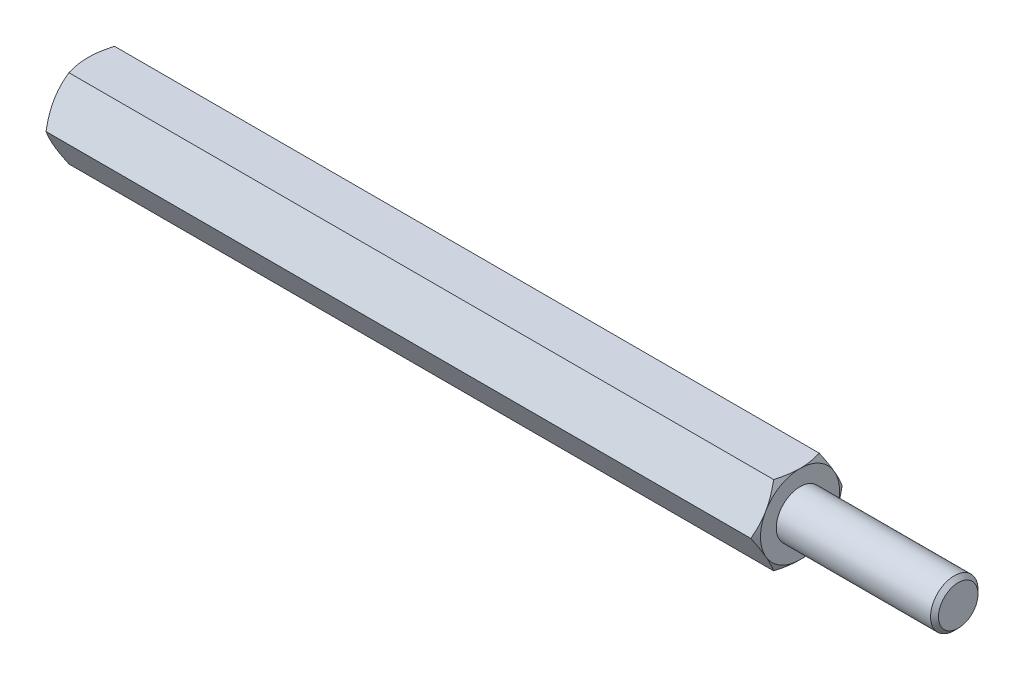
ISO-10303-21;
HEADER;
FILE_DESCRIPTION(('STEP AP214'),'2;1');
FILE_NAME('part.step','',(''),(''),'','','');
FILE_SCHEMA(('AUTOMOTIVE_DESIGN { 1 0 10303 214 1 1 1 1 }'));
ENDSEC;
DATA;
#1=APPLICATION_CONTEXT('core data for automotive mechanical design processes');
#2=APPLICATION_PROTOCOL_DEFINITION('international standard','automotive_design',2000,#1);
#3=PRODUCT_CONTEXT('',#1,'mechanical');
#4=PRODUCT('Part','Part','',(#3));
#5=PRODUCT_RELATED_PRODUCT_CATEGORY('part','',(#4));
#6=PRODUCT_DEFINITION_FORMATION('','',#4);
#7=PRODUCT_DEFINITION_CONTEXT('part definition',#1,'design');
#8=PRODUCT_DEFINITION('design','',#6,#7);
#9=PRODUCT_DEFINITION_SHAPE('','',#8);
#10=(LENGTH_UNIT() NAMED_UNIT(*) SI_UNIT(.MILLI.,.METRE.));
#11=(NAMED_UNIT(*) PLANE_ANGLE_UNIT() SI_UNIT($,.RADIAN.));
#12=(NAMED_UNIT(*) SI_UNIT($,.STERADIAN.) SOLID_ANGLE_UNIT());
#13=UNCERTAINTY_MEASURE_WITH_UNIT(LENGTH_MEASURE(1.E-05),#10,'distance_accuracy_value','');
#14=(GEOMETRIC_REPRESENTATION_CONTEXT(3) GLOBAL_UNCERTAINTY_ASSIGNED_CONTEXT((#13)) GLOBAL_UNIT_ASSIGNED_CONTEXT((#10,
#11,#12)) REPRESENTATION_CONTEXT('',''));
#15=CARTESIAN_POINT('',(0.,0.,0.));
#16=DIRECTION('',(0.,0.,1.));
#17=DIRECTION('',(1.,0.,0.));
#18=AXIS2_PLACEMENT_3D('',#15,#16,#17);
#19=CARTESIAN_POINT('',(22.5,2.5,-1.44337567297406));
#20=DIRECTION('',(1.,0.,0.));
#21=DIRECTION('',(0.,0.,-1.));
#22=AXIS2_PLACEMENT_3D('',#19,#20,#21);
#23=PLANE('',#22);
#24=CARTESIAN_POINT('',(22.5,0.,0.));
#25=DIRECTION('',(1.,0.,0.));
#26=DIRECTION('',(0.,0.,-1.));
#27=AXIS2_PLACEMENT_3D('',#24,#25,#26);
#28=CIRCLE('',#27,2.5);
#29=CARTESIAN_POINT('',(22.5,-1.25,-2.16506350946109));
#30=VERTEX_POINT('',#29);
#31=CARTESIAN_POINT('',(22.5,1.25,-2.1650635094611));
#32=VERTEX_POINT('',#31);
#33=EDGE_CURVE('E288',#30,#32,#28,.T.);
#34=ORIENTED_EDGE('',*,*,#33,.T.);
#35=CARTESIAN_POINT('',(22.5,2.5,0.));
#36=VERTEX_POINT('',#35);
#37=EDGE_CURVE('E53',#32,#36,#28,.T.);
#38=ORIENTED_EDGE('',*,*,#37,.T.);
#39=CARTESIAN_POINT('',(22.5,1.25,2.1650635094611));
#40=VERTEX_POINT('',#39);
#41=EDGE_CURVE('E297',#36,#40,#28,.T.);
#42=ORIENTED_EDGE('',*,*,#41,.T.);
#43=CARTESIAN_POINT('',(22.5,-1.25000000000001,2.1650635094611));
#44=VERTEX_POINT('',#43);
#45=EDGE_CURVE('E303',#40,#44,#28,.T.);
#46=ORIENTED_EDGE('',*,*,#45,.T.);
#47=CARTESIAN_POINT('',(22.5,0.,0.));
#48=DIRECTION('',(-1.,0.,0.));
#49=DIRECTION('',(0.,-1.,0.));
#50=AXIS2_PLACEMENT_3D('',#47,#48,#49);
#51=CIRCLE('',#50,2.5);
#52=CARTESIAN_POINT('',(22.5,-2.50000000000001,0.));
#53=VERTEX_POINT('',#52);
#54=EDGE_CURVE('E193',#53,#44,#51,.T.);
#55=ORIENTED_EDGE('',*,*,#54,.F.);
#56=EDGE_CURVE('E61',#53,#30,#28,.T.);
#57=ORIENTED_EDGE('',*,*,#56,.T.);
#58=EDGE_LOOP('',(#34,#38,#42,#46,#55,#57));
#59=FACE_BOUND('',#58,.T.);
#60=CARTESIAN_POINT('',(22.5,0.,0.));
#61=DIRECTION('',(1.,0.,0.));
#62=DIRECTION('',(0.,0.,-1.));
#63=AXIS2_PLACEMENT_3D('',#60,#61,#62);
#64=CIRCLE('',#63,1.5);
#65=CARTESIAN_POINT('',(22.5,0.,-1.5));
#66=VERTEX_POINT('',#65);
#67=EDGE_CURVE('E314',#66,#66,#64,.T.);
#68=ORIENTED_EDGE('',*,*,#67,.F.);
#69=EDGE_LOOP('',(#68));
#70=FACE_BOUND('',#69,.T.);
#71=ADVANCED_FACE('F37',(#59,#70),#23,.T.);
#72=CARTESIAN_POINT('',(22.5,0.,-2.88675134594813));
#73=DIRECTION('',(0.,-0.5,0.866025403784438));
#74=DIRECTION('',(0.,-0.866025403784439,-0.5));
#75=AXIS2_PLACEMENT_3D('',#72,#73,#74);
#76=PLANE('',#75);
#77=CARTESIAN_POINT('',(22.2766423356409,-0.000199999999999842,-2.88686681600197));
#78=CARTESIAN_POINT('',(22.3132783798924,0.109663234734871,-2.82343724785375));
#79=CARTESIAN_POINT('',(22.3465977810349,0.220474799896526,-2.75946016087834));
#80=CARTESIAN_POINT('',(22.4047577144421,0.44401683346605,-2.63039810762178));
#81=CARTESIAN_POINT('',(22.4295776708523,0.556751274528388,-2.5653108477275));
#82=CARTESIAN_POINT('',(22.4682143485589,0.780822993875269,-2.43594298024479));
#83=CARTESIAN_POINT('',(22.4822882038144,0.892125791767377,-2.37168227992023));
#84=CARTESIAN_POINT('',(22.4990908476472,1.11525522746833,-2.24285844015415));
#85=CARTESIAN_POINT('',(22.5018335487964,1.22708105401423,-2.17829576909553));
#86=CARTESIAN_POINT('',(22.4961342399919,1.43604197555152,-2.05765212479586));
#87=CARTESIAN_POINT('',(22.4890916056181,1.53320831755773,-2.0015531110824));
#88=CARTESIAN_POINT('',(22.4667685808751,1.726907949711,-1.88972057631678));
#89=CARTESIAN_POINT('',(22.4514805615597,1.82344056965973,-1.8339874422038));
#90=CARTESIAN_POINT('',(22.4132609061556,2.01753972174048,-1.7219242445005));
#91=CARTESIAN_POINT('',(22.3901672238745,2.11508168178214,-1.66560836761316));
#92=CARTESIAN_POINT('',(22.3377533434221,2.30871060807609,-1.55381665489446));
#93=CARTESIAN_POINT('',(22.3084454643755,2.40480005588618,-1.49833938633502));
#94=CARTESIAN_POINT('',(22.2766423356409,2.5002,-1.44326020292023));
#95=B_SPLINE_CURVE_WITH_KNOTS('',3,(#77,#78,#79,#80,#81,#82,#83,#84,#85,#86,#87,#88,#89,#90,#91,
#92,#93,#94),.UNSPECIFIED.,.F.,.F.,(4,2,2,2,2,2,2,2,4),(0.,0.396285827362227,0.793524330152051,
1.18093086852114,1.56786160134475,1.90479741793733,2.24204551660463,2.58677531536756,
2.93082800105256),.UNSPECIFIED.);
#96=CARTESIAN_POINT('',(22.2767090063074,0.,-2.88675134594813));
#97=VERTEX_POINT('',#96);
#98=EDGE_CURVE('E351',#97,#32,#95,.T.);
#99=ORIENTED_EDGE('',*,*,#98,.F.);
#100=DIRECTION('',(-1.,0.,0.));
#101=VECTOR('',#100,1.);
#102=CARTESIAN_POINT('',(22.5,0.,-2.88675134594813));
#103=LINE('',#102,#101);
#104=CARTESIAN_POINT('',(-22.2767090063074,0.,-2.88675134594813));
#105=VERTEX_POINT('',#104);
#106=EDGE_CURVE('E264',#97,#105,#103,.T.);
#107=ORIENTED_EDGE('',*,*,#106,.T.);
#108=CARTESIAN_POINT('',(-22.2766423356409,2.5002,-1.44326020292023));
#109=CARTESIAN_POINT('',(-22.3132783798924,2.39033676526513,-1.50668977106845));
#110=CARTESIAN_POINT('',(-22.3465977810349,2.27952520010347,-1.57066685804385));
#111=CARTESIAN_POINT('',(-22.4047577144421,2.05598316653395,-1.69972891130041));
#112=CARTESIAN_POINT('',(-22.4295776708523,1.94324872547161,-1.7648161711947));
#113=CARTESIAN_POINT('',(-22.4682143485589,1.71917700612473,-1.8941840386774));
#114=CARTESIAN_POINT('',(-22.4822882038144,1.60787420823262,-1.95844473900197));
#115=CARTESIAN_POINT('',(-22.4990908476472,1.38474477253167,-2.08726857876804));
#116=CARTESIAN_POINT('',(-22.5018335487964,1.27291894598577,-2.15183124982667));
#117=CARTESIAN_POINT('',(-22.4961342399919,1.06395802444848,-2.27247489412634));
#118=CARTESIAN_POINT('',(-22.4890916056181,0.96679168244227,-2.32857390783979));
#119=CARTESIAN_POINT('',(-22.4667685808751,0.773092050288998,-2.44040644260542));
#120=CARTESIAN_POINT('',(-22.4514805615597,0.676559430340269,-2.49613957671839));
#121=CARTESIAN_POINT('',(-22.4132609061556,0.482460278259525,-2.60820277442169));
#122=CARTESIAN_POINT('',(-22.3901672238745,0.384918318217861,-2.66451865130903));
#123=CARTESIAN_POINT('',(-22.3377533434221,0.191289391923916,-2.77631036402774));
#124=CARTESIAN_POINT('',(-22.3084454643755,0.0951999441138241,-2.83178763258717));
#125=CARTESIAN_POINT('',(-22.2766423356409,-0.000199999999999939,-2.88686681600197));
#126=B_SPLINE_CURVE_WITH_KNOTS('',3,(#108,#109,#110,#111,#112,#113,#114,#115,#116,#117,#118,
#119,#120,#121,#122,#123,#124,#125),.UNSPECIFIED.,.F.,.F.,(4,2,2,2,2,2,2,2,4),(0.,
0.396285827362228,0.793524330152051,1.18093086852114,1.56786160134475,1.90479741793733,
2.24204551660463,2.58677531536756,2.93082800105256),.UNSPECIFIED.);
#127=CARTESIAN_POINT('',(-22.5,1.25,-2.1650635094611));
#128=VERTEX_POINT('',#127);
#129=EDGE_CURVE('E342',#128,#105,#126,.T.);
#130=ORIENTED_EDGE('',*,*,#129,.F.);
#131=CARTESIAN_POINT('',(-22.2767090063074,2.5,-1.44337567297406));
#132=VERTEX_POINT('',#131);
#133=EDGE_CURVE('E392',#132,#128,#126,.T.);
#134=ORIENTED_EDGE('',*,*,#133,.F.);
#135=DIRECTION('',(-1.,0.,0.));
#136=VECTOR('',#135,1.);
#137=CARTESIAN_POINT('',(22.5,2.5,-1.44337567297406));
#138=LINE('',#137,#136);
#139=CARTESIAN_POINT('',(22.2767090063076,2.5,-1.44337567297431));
#140=VERTEX_POINT('',#139);
#141=EDGE_CURVE('E279',#140,#132,#138,.T.);
#142=ORIENTED_EDGE('',*,*,#141,.F.);
#143=EDGE_CURVE('E229',#32,#140,#95,.T.);
#144=ORIENTED_EDGE('',*,*,#143,.F.);
#145=EDGE_LOOP('',(#99,#107,#130,#134,#142,#144));
#146=FACE_BOUND('',#145,.T.);
#147=ADVANCED_FACE('F148',(#146),#76,.F.);
#148=CARTESIAN_POINT('',(22.5,2.5,-1.44337567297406));
#149=DIRECTION('',(0.,-1.,0.));
#150=DIRECTION('',(0.,0.,-1.));
#151=AXIS2_PLACEMENT_3D('',#148,#149,#150);
#152=PLANE('',#151);
#153=CARTESIAN_POINT('',(21.2680338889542,2.5,-3.90158441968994));
#154=CARTESIAN_POINT('',(21.3212077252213,2.5,-3.79217004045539));
#155=CARTESIAN_POINT('',(21.3738786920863,2.5,-3.68250707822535));
#156=CARTESIAN_POINT('',(21.4779324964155,2.5,-3.46255185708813));
#157=CARTESIAN_POINT('',(21.5293151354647,2.5,-3.35225950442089));
#158=CARTESIAN_POINT('',(21.6307630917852,2.5,-3.13035696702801));
#159=CARTESIAN_POINT('',(21.6808199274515,2.5,-3.0187428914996));
#160=CARTESIAN_POINT('',(21.7789171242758,2.5,-2.79463535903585));
#161=CARTESIAN_POINT('',(21.8269575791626,2.5,-2.68214194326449));
#162=CARTESIAN_POINT('',(21.9220184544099,2.5,-2.45240385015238));
#163=CARTESIAN_POINT('',(21.9689543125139,2.5,-2.33512399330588));
#164=CARTESIAN_POINT('',(22.0593326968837,2.5,-2.09920133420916));
#165=CARTESIAN_POINT('',(22.1027748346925,2.5,-1.98055838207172));
#166=CARTESIAN_POINT('',(22.1850435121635,2.5,-1.74193489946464));
#167=CARTESIAN_POINT('',(22.2238791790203,2.5,-1.62195754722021));
#168=CARTESIAN_POINT('',(22.2957050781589,2.5,-1.38028205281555));
#169=CARTESIAN_POINT('',(22.3286971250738,2.5,-1.25858445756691));
#170=CARTESIAN_POINT('',(22.3870959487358,2.5,-1.01406369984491));
#171=CARTESIAN_POINT('',(22.4125437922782,2.5,-0.891250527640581));
#172=CARTESIAN_POINT('',(22.4544275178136,2.5,-0.64407172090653));
#173=CARTESIAN_POINT('',(22.4708643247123,2.5,-0.519706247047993));
#174=CARTESIAN_POINT('',(22.4932006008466,2.5,-0.271679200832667));
#175=CARTESIAN_POINT('',(22.4992375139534,2.5,-0.148030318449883));
#176=CARTESIAN_POINT('',(22.5006256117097,2.5,0.0993395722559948));
#177=CARTESIAN_POINT('',(22.4959765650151,2.5,0.223060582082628));
#178=CARTESIAN_POINT('',(22.4794044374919,2.5,0.432351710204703));
#179=CARTESIAN_POINT('',(22.4701066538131,2.5,0.518143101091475));
#180=CARTESIAN_POINT('',(22.4469384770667,2.5,0.689112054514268));
#181=CARTESIAN_POINT('',(22.4330674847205,2.5,0.774289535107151));
#182=CARTESIAN_POINT('',(22.3853202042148,2.5,1.02876599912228));
#183=CARTESIAN_POINT('',(22.3453176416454,2.5,1.19691958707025));
#184=CARTESIAN_POINT('',(22.2522656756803,2.5,1.53362893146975));
#185=CARTESIAN_POINT('',(22.1989362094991,2.5,1.70210423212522));
#186=CARTESIAN_POINT('',(22.1123716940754,2.5,1.95247339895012));
#187=CARTESIAN_POINT('',(22.0824247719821,2.5,2.03553184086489));
#188=CARTESIAN_POINT('',(22.0206840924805,2.5,2.20095860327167));
#189=CARTESIAN_POINT('',(21.9888903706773,2.5,2.28332693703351));
#190=CARTESIAN_POINT('',(21.904014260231,2.5,2.49723312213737));
#191=CARTESIAN_POINT('',(21.8497173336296,2.5,2.62828796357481));
#192=CARTESIAN_POINT('',(21.7381273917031,2.5,2.88912034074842));
#193=CARTESIAN_POINT('',(21.6808341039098,2.5,3.01889775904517));
#194=CARTESIAN_POINT('',(21.5639348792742,2.5,3.27745045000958));
#195=CARTESIAN_POINT('',(21.504328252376,2.5,3.40622540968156));
#196=CARTESIAN_POINT('',(21.3833234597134,2.5,3.66293235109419));
#197=CARTESIAN_POINT('',(21.321925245,2.5,3.7908643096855));
#198=CARTESIAN_POINT('',(21.1354580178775,2.5,4.17399495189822));
#199=CARTESIAN_POINT('',(21.0082824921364,2.5,4.42816724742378));
#200=CARTESIAN_POINT('',(20.7503455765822,2.5,4.93461464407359));
#201=CARTESIAN_POINT('',(20.6195848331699,2.5,5.1868900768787));
#202=CARTESIAN_POINT('',(20.3687100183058,2.5,5.66512451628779));
#203=CARTESIAN_POINT('',(20.2488298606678,2.5,5.89120644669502));
#204=CARTESIAN_POINT('',(20.0075902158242,2.5,6.34259369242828));
#205=CARTESIAN_POINT('',(19.8862306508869,2.5,6.56789896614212));
#206=CARTESIAN_POINT('',(19.642780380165,2.5,7.01722044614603));
#207=CARTESIAN_POINT('',(19.5206930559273,2.5,7.24123848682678));
#208=CARTESIAN_POINT('',(19.2756662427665,2.5,7.68878772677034));
#209=CARTESIAN_POINT('',(19.152726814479,2.5,7.91231895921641));
#210=CARTESIAN_POINT('',(19.0294756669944,2.5,8.13567697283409));
#211=B_SPLINE_CURVE_WITH_KNOTS('',3,(#153,#154,#155,#156,#157,#158,#159,#160,#161,#162,#163,
#164,#165,#166,#167,#168,#169,#170,#171,#172,#173,#174,#175,#176,#177,#178,#179,#180,#181,#182,
#183,#184,#185,#186,#187,#188,#189,#190,#191,#192,#193,#194,#195,#196,#197,#198,#199,#200,#201,
#202,#203,#204,#205,#206,#207,#208,#209,#210),.UNSPECIFIED.,.F.,.F.,(4,2,2,2,2,2,2,2,2,2,2,2,2,
2,2,2,2,2,2,2,2,2,2,2,2,2,2,2,4),(0.,0.364957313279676,0.729970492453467,1.09692930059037,
1.46387103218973,1.84279746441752,2.22176597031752,2.59997058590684,2.97805755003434,
3.3540469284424,3.72999770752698,4.10094071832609,4.47189175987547,4.73064905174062,
4.98944026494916,5.50729076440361,6.037104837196,6.30196454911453,6.56681915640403,
6.99233818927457,7.41789598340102,7.84358170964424,8.26927907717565,9.12186602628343,
9.97430025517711,10.7419897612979,11.509719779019,12.2750964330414,13.0404191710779),.UNSPECIFIED.);
#212=EDGE_CURVE('E227',#140,#36,#211,.T.);
#213=ORIENTED_EDGE('',*,*,#212,.F.);
#214=ORIENTED_EDGE('',*,*,#141,.T.);
#215=CARTESIAN_POINT('',(-21.2680338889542,2.5,-3.90158441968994));
#216=CARTESIAN_POINT('',(-21.3212077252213,2.5,-3.79217004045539));
#217=CARTESIAN_POINT('',(-21.3738786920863,2.5,-3.68250707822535));
#218=CARTESIAN_POINT('',(-21.4779324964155,2.5,-3.46255185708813));
#219=CARTESIAN_POINT('',(-21.5293151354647,2.5,-3.35225950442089));
#220=CARTESIAN_POINT('',(-21.6307630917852,2.5,-3.13035696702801));
#221=CARTESIAN_POINT('',(-21.6808199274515,2.5,-3.0187428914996));
#222=CARTESIAN_POINT('',(-21.7789171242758,2.5,-2.79463535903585));
#223=CARTESIAN_POINT('',(-21.8269575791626,2.5,-2.68214194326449));
#224=CARTESIAN_POINT('',(-21.9220184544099,2.5,-2.45240385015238));
#225=CARTESIAN_POINT('',(-21.9689543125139,2.5,-2.33512399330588));
#226=CARTESIAN_POINT('',(-22.0593326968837,2.5,-2.09920133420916));
#227=CARTESIAN_POINT('',(-22.1027748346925,2.5,-1.98055838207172));
#228=CARTESIAN_POINT('',(-22.1850435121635,2.5,-1.74193489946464));
#229=CARTESIAN_POINT('',(-22.2238791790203,2.5,-1.62195754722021));
#230=CARTESIAN_POINT('',(-22.2957050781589,2.5,-1.38028205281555));
#231=CARTESIAN_POINT('',(-22.3286971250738,2.5,-1.25858445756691));
#232=CARTESIAN_POINT('',(-22.3870959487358,2.5,-1.01406369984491));
#233=CARTESIAN_POINT('',(-22.4125437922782,2.5,-0.891250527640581));
#234=CARTESIAN_POINT('',(-22.4544275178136,2.5,-0.64407172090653));
#235=CARTESIAN_POINT('',(-22.4708643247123,2.5,-0.519706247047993));
#236=CARTESIAN_POINT('',(-22.4932006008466,2.5,-0.271679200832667));
#237=CARTESIAN_POINT('',(-22.4992375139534,2.5,-0.148030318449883));
#238=CARTESIAN_POINT('',(-22.5006256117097,2.5,0.0993395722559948));
#239=CARTESIAN_POINT('',(-22.4959765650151,2.5,0.223060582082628));
#240=CARTESIAN_POINT('',(-22.4794044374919,2.5,0.432351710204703));
#241=CARTESIAN_POINT('',(-22.4701066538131,2.5,0.518143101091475));
#242=CARTESIAN_POINT('',(-22.4469384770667,2.5,0.689112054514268));
#243=CARTESIAN_POINT('',(-22.4330674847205,2.5,0.774289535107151));
#244=CARTESIAN_POINT('',(-22.3853202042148,2.5,1.02876599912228));
#245=CARTESIAN_POINT('',(-22.3453176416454,2.5,1.19691958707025));
#246=CARTESIAN_POINT('',(-22.2522656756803,2.5,1.53362893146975));
#247=CARTESIAN_POINT('',(-22.1989362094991,2.5,1.70210423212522));
#248=CARTESIAN_POINT('',(-22.1123716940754,2.5,1.95247339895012));
#249=CARTESIAN_POINT('',(-22.0824247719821,2.5,2.03553184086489));
#250=CARTESIAN_POINT('',(-22.0206840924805,2.5,2.20095860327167));
#251=CARTESIAN_POINT('',(-21.9888903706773,2.5,2.28332693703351));
#252=CARTESIAN_POINT('',(-21.904014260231,2.5,2.49723312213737));
#253=CARTESIAN_POINT('',(-21.8497173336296,2.5,2.62828796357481));
#254=CARTESIAN_POINT('',(-21.7381273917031,2.5,2.88912034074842));
#255=CARTESIAN_POINT('',(-21.6808341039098,2.5,3.01889775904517));
#256=CARTESIAN_POINT('',(-21.5639348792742,2.5,3.27745045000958));
#257=CARTESIAN_POINT('',(-21.504328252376,2.5,3.40622540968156));
#258=CARTESIAN_POINT('',(-21.3833234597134,2.5,3.66293235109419));
#259=CARTESIAN_POINT('',(-21.321925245,2.5,3.7908643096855));
#260=CARTESIAN_POINT('',(-21.1354580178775,2.5,4.17399495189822));
#261=CARTESIAN_POINT('',(-21.0082824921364,2.5,4.42816724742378));
#262=CARTESIAN_POINT('',(-20.7503455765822,2.5,4.93461464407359));
#263=CARTESIAN_POINT('',(-20.6195848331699,2.5,5.1868900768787));
#264=CARTESIAN_POINT('',(-20.3687100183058,2.5,5.66512451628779));
#265=CARTESIAN_POINT('',(-20.2488298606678,2.5,5.89120644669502));
#266=CARTESIAN_POINT('',(-20.0075902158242,2.5,6.34259369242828));
#267=CARTESIAN_POINT('',(-19.8862306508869,2.5,6.56789896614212));
#268=CARTESIAN_POINT('',(-19.642780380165,2.5,7.01722044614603));
#269=CARTESIAN_POINT('',(-19.5206930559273,2.5,7.24123848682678));
#270=CARTESIAN_POINT('',(-19.2756662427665,2.5,7.68878772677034));
#271=CARTESIAN_POINT('',(-19.152726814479,2.5,7.91231895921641));
#272=CARTESIAN_POINT('',(-19.0294756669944,2.5,8.13567697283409));
#273=B_SPLINE_CURVE_WITH_KNOTS('',3,(#215,#216,#217,#218,#219,#220,#221,#222,#223,#224,#225,
#226,#227,#228,#229,#230,#231,#232,#233,#234,#235,#236,#237,#238,#239,#240,#241,#242,#243,#244,
#245,#246,#247,#248,#249,#250,#251,#252,#253,#254,#255,#256,#257,#258,#259,#260,#261,#262,#263,
#264,#265,#266,#267,#268,#269,#270,#271,#272),.UNSPECIFIED.,.F.,.F.,(4,2,2,2,2,2,2,2,2,2,2,2,2,
2,2,2,2,2,2,2,2,2,2,2,2,2,2,2,4),(0.,0.364957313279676,0.729970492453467,1.09692930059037,
1.46387103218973,1.84279746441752,2.22176597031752,2.59997058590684,2.97805755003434,
3.3540469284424,3.72999770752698,4.10094071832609,4.47189175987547,4.73064905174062,
4.98944026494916,5.50729076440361,6.037104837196,6.30196454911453,6.56681915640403,
6.99233818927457,7.41789598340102,7.84358170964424,8.26927907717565,9.12186602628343,
9.97430025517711,10.7419897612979,11.509719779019,12.2750964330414,13.0404191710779),.UNSPECIFIED.);
#274=CARTESIAN_POINT('',(-22.5,2.5,0.));
#275=VERTEX_POINT('',#274);
#276=EDGE_CURVE('E241',#275,#132,#273,.F.);
#277=ORIENTED_EDGE('',*,*,#276,.F.);
#278=CARTESIAN_POINT('',(-22.2767090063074,2.5,1.44337567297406));
#279=VERTEX_POINT('',#278);
#280=EDGE_CURVE('E249',#279,#275,#273,.F.);
#281=ORIENTED_EDGE('',*,*,#280,.F.);
#282=DIRECTION('',(-1.,0.,0.));
#283=VECTOR('',#282,1.);
#284=CARTESIAN_POINT('',(22.5,2.5,1.44337567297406));
#285=LINE('',#284,#283);
#286=CARTESIAN_POINT('',(22.2767090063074,2.5,1.44337567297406));
#287=VERTEX_POINT('',#286);
#288=EDGE_CURVE('E276',#287,#279,#285,.T.);
#289=ORIENTED_EDGE('',*,*,#288,.F.);
#290=EDGE_CURVE('E221',#36,#287,#211,.T.);
#291=ORIENTED_EDGE('',*,*,#290,.F.);
#292=EDGE_LOOP('',(#213,#214,#277,#281,#289,#291));
#293=FACE_BOUND('',#292,.T.);
#294=ADVANCED_FACE('F153',(#293),#152,.F.);
#295=CARTESIAN_POINT('',(22.5,2.5,1.44337567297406));
#296=DIRECTION('',(0.,-0.5,-0.866025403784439));
#297=DIRECTION('',(0.,0.866025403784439,-0.5));
#298=AXIS2_PLACEMENT_3D('',#295,#296,#297);
#299=PLANE('',#298);
#300=CARTESIAN_POINT('',(22.2766423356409,2.5002,1.44326020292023));
#301=CARTESIAN_POINT('',(22.3132783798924,2.39033676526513,1.50668977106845));
#302=CARTESIAN_POINT('',(22.3465977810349,2.27952520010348,1.57066685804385));
#303=CARTESIAN_POINT('',(22.4047577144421,2.05598316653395,1.69972891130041));
#304=CARTESIAN_POINT('',(22.4295776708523,1.94324872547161,1.7648161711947));
#305=CARTESIAN_POINT('',(22.4682143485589,1.71917700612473,1.8941840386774));
#306=CARTESIAN_POINT('',(22.4822882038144,1.60787420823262,1.95844473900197));
#307=CARTESIAN_POINT('',(22.4990908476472,1.38474477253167,2.08726857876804));
#308=CARTESIAN_POINT('',(22.5018335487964,1.27291894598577,2.15183124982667));
#309=CARTESIAN_POINT('',(22.4961342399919,1.06395802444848,2.27247489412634));
#310=CARTESIAN_POINT('',(22.4890916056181,0.966791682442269,2.32857390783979));
#311=CARTESIAN_POINT('',(22.4667685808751,0.773092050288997,2.44040644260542));
#312=CARTESIAN_POINT('',(22.4514805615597,0.676559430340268,2.4961395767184));
#313=CARTESIAN_POINT('',(22.4132609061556,0.482460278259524,2.60820277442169));
#314=CARTESIAN_POINT('',(22.3901672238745,0.38491831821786,2.66451865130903));
#315=CARTESIAN_POINT('',(22.3377533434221,0.191289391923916,2.77631036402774));
#316=CARTESIAN_POINT('',(22.3084454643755,0.0951999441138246,2.83178763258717));
#317=CARTESIAN_POINT('',(22.2766423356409,-0.000199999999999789,2.88686681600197));
#318=B_SPLINE_CURVE_WITH_KNOTS('',3,(#300,#301,#302,#303,#304,#305,#306,#307,#308,#309,#310,
#311,#312,#313,#314,#315,#316,#317),.UNSPECIFIED.,.F.,.F.,(4,2,2,2,2,2,2,2,4),(0.,
0.396285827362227,0.793524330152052,1.18093086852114,1.56786160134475,1.90479741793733,
2.24204551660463,2.58677531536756,2.93082800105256),.UNSPECIFIED.);
#319=EDGE_CURVE('E228',#287,#40,#318,.T.);
#320=ORIENTED_EDGE('',*,*,#319,.F.);
#321=ORIENTED_EDGE('',*,*,#288,.T.);
#322=CARTESIAN_POINT('',(-22.2766423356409,-0.000199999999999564,2.88686681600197));
#323=CARTESIAN_POINT('',(-22.3132783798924,0.109663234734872,2.82343724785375));
#324=CARTESIAN_POINT('',(-22.3465977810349,0.220474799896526,2.75946016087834));
#325=CARTESIAN_POINT('',(-22.4047577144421,0.44401683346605,2.63039810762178));
#326=CARTESIAN_POINT('',(-22.4295776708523,0.556751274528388,2.5653108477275));
#327=CARTESIAN_POINT('',(-22.4682143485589,0.780822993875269,2.43594298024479));
#328=CARTESIAN_POINT('',(-22.4822882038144,0.892125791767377,2.37168227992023));
#329=CARTESIAN_POINT('',(-22.4990908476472,1.11525522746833,2.24285844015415));
#330=CARTESIAN_POINT('',(-22.5018335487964,1.22708105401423,2.17829576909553));
#331=CARTESIAN_POINT('',(-22.4961342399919,1.43604197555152,2.05765212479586));
#332=CARTESIAN_POINT('',(-22.4890916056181,1.53320831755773,2.0015531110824));
#333=CARTESIAN_POINT('',(-22.4667685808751,1.726907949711,1.88972057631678));
#334=CARTESIAN_POINT('',(-22.4514805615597,1.82344056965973,1.8339874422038));
#335=CARTESIAN_POINT('',(-22.4132609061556,2.01753972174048,1.7219242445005));
#336=CARTESIAN_POINT('',(-22.3901672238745,2.11508168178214,1.66560836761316));
#337=CARTESIAN_POINT('',(-22.3377533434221,2.30871060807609,1.55381665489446));
#338=CARTESIAN_POINT('',(-22.3084454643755,2.40480005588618,1.49833938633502));
#339=CARTESIAN_POINT('',(-22.2766423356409,2.5002,1.44326020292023));
#340=B_SPLINE_CURVE_WITH_KNOTS('',3,(#322,#323,#324,#325,#326,#327,#328,#329,#330,#331,#332,
#333,#334,#335,#336,#337,#338,#339),.UNSPECIFIED.,.F.,.F.,(4,2,2,2,2,2,2,2,4),(0.,
0.396285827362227,0.79352433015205,1.18093086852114,1.56786160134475,1.90479741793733,
2.24204551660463,2.58677531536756,2.93082800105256),.UNSPECIFIED.);
#341=CARTESIAN_POINT('',(-22.5,1.25,2.1650635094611));
#342=VERTEX_POINT('',#341);
#343=EDGE_CURVE('E255',#342,#279,#340,.T.);
#344=ORIENTED_EDGE('',*,*,#343,.F.);
#345=CARTESIAN_POINT('',(-22.2767090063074,0.,2.88675134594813));
#346=VERTEX_POINT('',#345);
#347=EDGE_CURVE('E262',#346,#342,#340,.T.);
#348=ORIENTED_EDGE('',*,*,#347,.F.);
#349=DIRECTION('',(-1.,0.,0.));
#350=VECTOR('',#349,1.);
#351=CARTESIAN_POINT('',(22.5,0.,2.88675134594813));
#352=LINE('',#351,#350);
#353=CARTESIAN_POINT('',(22.2767090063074,0.,2.88675134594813));
#354=VERTEX_POINT('',#353);
#355=EDGE_CURVE('E273',#354,#346,#352,.T.);
#356=ORIENTED_EDGE('',*,*,#355,.F.);
#357=EDGE_CURVE('E215',#40,#354,#318,.T.);
#358=ORIENTED_EDGE('',*,*,#357,.F.);
#359=EDGE_LOOP('',(#320,#321,#344,#348,#356,#358));
#360=FACE_BOUND('',#359,.T.);
#361=ADVANCED_FACE('F235',(#360),#299,.F.);
#362=CARTESIAN_POINT('',(22.5,0.,2.88675134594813));
#363=DIRECTION('',(0.,0.5,-0.866025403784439));
#364=DIRECTION('',(0.,0.866025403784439,0.5));
#365=AXIS2_PLACEMENT_3D('',#362,#363,#364);
#366=PLANE('',#365);
#367=CARTESIAN_POINT('',(22.2766423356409,0.000200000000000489,2.88686681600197));
#368=CARTESIAN_POINT('',(22.3132783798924,-0.10966323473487,2.82343724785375));
#369=CARTESIAN_POINT('',(22.3465977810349,-0.220474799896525,2.75946016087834));
#370=CARTESIAN_POINT('',(22.4047577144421,-0.444016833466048,2.63039810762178));
#371=CARTESIAN_POINT('',(22.4295776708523,-0.556751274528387,2.5653108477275));
#372=CARTESIAN_POINT('',(22.4682143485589,-0.780822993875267,2.43594298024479));
#373=CARTESIAN_POINT('',(22.4822882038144,-0.892125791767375,2.37168227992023));
#374=CARTESIAN_POINT('',(22.4990908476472,-1.11525522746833,2.24285844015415));
#375=CARTESIAN_POINT('',(22.5018335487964,-1.22708105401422,2.17829576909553));
#376=CARTESIAN_POINT('',(22.4961342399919,-1.43604197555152,2.05765212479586));
#377=CARTESIAN_POINT('',(22.4890916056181,-1.53320831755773,2.0015531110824));
#378=CARTESIAN_POINT('',(22.4667685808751,-1.726907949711,1.88972057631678));
#379=CARTESIAN_POINT('',(22.4514805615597,-1.82344056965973,1.8339874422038));
#380=CARTESIAN_POINT('',(22.4132609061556,-2.01753972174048,1.7219242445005));
#381=CARTESIAN_POINT('',(22.3901672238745,-2.11508168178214,1.66560836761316));
#382=CARTESIAN_POINT('',(22.3377533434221,-2.30871060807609,1.55381665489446));
#383=CARTESIAN_POINT('',(22.3084454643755,-2.40480005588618,1.49833938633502));
#384=CARTESIAN_POINT('',(22.2766423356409,-2.5002,1.44326020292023));
#385=B_SPLINE_CURVE_WITH_KNOTS('',3,(#367,#368,#369,#370,#371,#372,#373,#374,#375,#376,#377,
#378,#379,#380,#381,#382,#383,#384),.UNSPECIFIED.,.F.,.F.,(4,2,2,2,2,2,2,2,4),(0.,
0.396285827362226,0.793524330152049,1.18093086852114,1.56786160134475,1.90479741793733,
2.24204551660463,2.58677531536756,2.93082800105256),.UNSPECIFIED.);
#386=EDGE_CURVE('E373',#354,#44,#385,.T.);
#387=ORIENTED_EDGE('',*,*,#386,.F.);
#388=ORIENTED_EDGE('',*,*,#355,.T.);
#389=CARTESIAN_POINT('',(-22.2766423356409,-2.5002,1.44326020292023));
#390=CARTESIAN_POINT('',(-22.3132783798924,-2.39033676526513,1.50668977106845));
#391=CARTESIAN_POINT('',(-22.3465977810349,-2.27952520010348,1.57066685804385));
#392=CARTESIAN_POINT('',(-22.4047577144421,-2.05598316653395,1.69972891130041));
#393=CARTESIAN_POINT('',(-22.4295776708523,-1.94324872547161,1.7648161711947));
#394=CARTESIAN_POINT('',(-22.468214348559,-1.71917700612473,1.8941840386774));
#395=CARTESIAN_POINT('',(-22.4822882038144,-1.60787420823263,1.95844473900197));
#396=CARTESIAN_POINT('',(-22.4990908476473,-1.38474477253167,2.08726857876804));
#397=CARTESIAN_POINT('',(-22.5018335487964,-1.27291894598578,2.15183124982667));
#398=CARTESIAN_POINT('',(-22.4961342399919,-1.06395802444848,2.27247489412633));
#399=CARTESIAN_POINT('',(-22.4890916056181,-0.966791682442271,2.32857390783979));
#400=CARTESIAN_POINT('',(-22.4667685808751,-0.773092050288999,2.44040644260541));
#401=CARTESIAN_POINT('',(-22.4514805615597,-0.676559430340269,2.49613957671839));
#402=CARTESIAN_POINT('',(-22.4132609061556,-0.482460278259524,2.60820277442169));
#403=CARTESIAN_POINT('',(-22.3901672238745,-0.38491831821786,2.66451865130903));
#404=CARTESIAN_POINT('',(-22.3377533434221,-0.191289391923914,2.77631036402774));
#405=CARTESIAN_POINT('',(-22.3084454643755,-0.0951999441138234,2.83178763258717));
#406=CARTESIAN_POINT('',(-22.2766423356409,0.000200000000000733,2.88686681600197));
#407=B_SPLINE_CURVE_WITH_KNOTS('',3,(#389,#390,#391,#392,#393,#394,#395,#396,#397,#398,#399,
#400,#401,#402,#403,#404,#405,#406),.UNSPECIFIED.,.F.,.F.,(4,2,2,2,2,2,2,2,4),(0.,
0.396285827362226,0.793524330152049,1.18093086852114,1.56786160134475,1.90479741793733,
2.24204551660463,2.58677531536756,2.93082800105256),.UNSPECIFIED.);
#408=CARTESIAN_POINT('',(-22.5,-1.25000000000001,2.1650635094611));
#409=VERTEX_POINT('',#408);
#410=EDGE_CURVE('E263',#409,#346,#407,.T.);
#411=ORIENTED_EDGE('',*,*,#410,.F.);
#412=CARTESIAN_POINT('',(-22.2767090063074,-2.5,1.44337567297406));
#413=VERTEX_POINT('',#412);
#414=EDGE_CURVE('E250',#413,#409,#407,.T.);
#415=ORIENTED_EDGE('',*,*,#414,.F.);
#416=DIRECTION('',(-1.,0.,0.));
#417=VECTOR('',#416,1.);
#418=CARTESIAN_POINT('',(22.5,-2.5,1.44337567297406));
#419=LINE('',#418,#417);
#420=CARTESIAN_POINT('',(22.2767090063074,-2.5,1.44337567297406));
#421=VERTEX_POINT('',#420);
#422=EDGE_CURVE('E270',#421,#413,#419,.T.);
#423=ORIENTED_EDGE('',*,*,#422,.F.);
#424=EDGE_CURVE('E210',#44,#421,#385,.T.);
#425=ORIENTED_EDGE('',*,*,#424,.F.);
#426=EDGE_LOOP('',(#387,#388,#411,#415,#423,#425));
#427=FACE_BOUND('',#426,.T.);
#428=ADVANCED_FACE('F442',(#427),#366,.F.);
#429=CARTESIAN_POINT('',(22.5,-2.5,1.44337567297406));
#430=DIRECTION('',(0.,1.,0.));
#431=DIRECTION('',(0.,0.,1.));
#432=AXIS2_PLACEMENT_3D('',#429,#430,#431);
#433=PLANE('',#432);
#434=CARTESIAN_POINT('',(21.2680338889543,-2.5,-3.90158441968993));
#435=CARTESIAN_POINT('',(21.3212077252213,-2.5,-3.79217004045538));
#436=CARTESIAN_POINT('',(21.3738786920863,-2.5,-3.68250707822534));
#437=CARTESIAN_POINT('',(21.4779324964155,-2.5,-3.46255185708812));
#438=CARTESIAN_POINT('',(21.5293151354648,-2.5,-3.35225950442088));
#439=CARTESIAN_POINT('',(21.6307630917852,-2.5,-3.130356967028));
#440=CARTESIAN_POINT('',(21.6808199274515,-2.5,-3.01874289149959));
#441=CARTESIAN_POINT('',(21.7789171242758,-2.5,-2.79463535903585));
#442=CARTESIAN_POINT('',(21.8269575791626,-2.5,-2.68214194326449));
#443=CARTESIAN_POINT('',(21.9220184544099,-2.5,-2.45240385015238));
#444=CARTESIAN_POINT('',(21.9689543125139,-2.5,-2.33512399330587));
#445=CARTESIAN_POINT('',(22.0593326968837,-2.5,-2.09920133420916));
#446=CARTESIAN_POINT('',(22.1027748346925,-2.5,-1.98055838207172));
#447=CARTESIAN_POINT('',(22.1850435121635,-2.5,-1.74193489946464));
#448=CARTESIAN_POINT('',(22.2238791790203,-2.5,-1.6219575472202));
#449=CARTESIAN_POINT('',(22.2957050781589,-2.5,-1.38028205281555));
#450=CARTESIAN_POINT('',(22.3286971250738,-2.5,-1.25858445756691));
#451=CARTESIAN_POINT('',(22.3870959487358,-2.5,-1.01406369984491));
#452=CARTESIAN_POINT('',(22.4125437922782,-2.5,-0.891250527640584));
#453=CARTESIAN_POINT('',(22.4544275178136,-2.5,-0.644071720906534));
#454=CARTESIAN_POINT('',(22.4708643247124,-2.5,-0.519706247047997));
#455=CARTESIAN_POINT('',(22.4932006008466,-2.5,-0.271679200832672));
#456=CARTESIAN_POINT('',(22.4992375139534,-2.5,-0.148030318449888));
#457=CARTESIAN_POINT('',(22.5006256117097,-2.5,0.0993395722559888));
#458=CARTESIAN_POINT('',(22.4959765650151,-2.5,0.223060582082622));
#459=CARTESIAN_POINT('',(22.4794044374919,-2.5,0.432351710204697));
#460=CARTESIAN_POINT('',(22.4701066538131,-2.5,0.518143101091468));
#461=CARTESIAN_POINT('',(22.4469384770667,-2.5,0.689112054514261));
#462=CARTESIAN_POINT('',(22.4330674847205,-2.5,0.774289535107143));
#463=CARTESIAN_POINT('',(22.3853202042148,-2.5,1.02876599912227));
#464=CARTESIAN_POINT('',(22.3453176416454,-2.5,1.19691958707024));
#465=CARTESIAN_POINT('',(22.2522656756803,-2.5,1.53362893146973));
#466=CARTESIAN_POINT('',(22.1989362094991,-2.5,1.70210423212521));
#467=CARTESIAN_POINT('',(22.1123716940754,-2.5,1.9524733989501));
#468=CARTESIAN_POINT('',(22.0824247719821,-2.5,2.03553184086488));
#469=CARTESIAN_POINT('',(22.0206840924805,-2.5,2.20095860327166));
#470=CARTESIAN_POINT('',(21.9888903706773,-2.5,2.28332693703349));
#471=CARTESIAN_POINT('',(21.904014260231,-2.5,2.49723312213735));
#472=CARTESIAN_POINT('',(21.8497173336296,-2.5,2.62828796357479));
#473=CARTESIAN_POINT('',(21.7381273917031,-2.5,2.88912034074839));
#474=CARTESIAN_POINT('',(21.6808341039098,-2.5,3.01889775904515));
#475=CARTESIAN_POINT('',(21.5639348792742,-2.5,3.27745045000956));
#476=CARTESIAN_POINT('',(21.504328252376,-2.5,3.40622540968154));
#477=CARTESIAN_POINT('',(21.3833234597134,-2.5,3.66293235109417));
#478=CARTESIAN_POINT('',(21.321925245,-2.5,3.79086430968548));
#479=CARTESIAN_POINT('',(21.1354580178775,-2.5,4.1739949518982));
#480=CARTESIAN_POINT('',(21.0082824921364,-2.5,4.42816724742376));
#481=CARTESIAN_POINT('',(20.7503455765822,-2.5,4.93461464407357));
#482=CARTESIAN_POINT('',(20.6195848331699,-2.5,5.18689007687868));
#483=CARTESIAN_POINT('',(20.3687100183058,-2.5,5.66512451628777));
#484=CARTESIAN_POINT('',(20.2488298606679,-2.5,5.891206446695));
#485=CARTESIAN_POINT('',(20.0075902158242,-2.5,6.34259369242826));
#486=CARTESIAN_POINT('',(19.8862306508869,-2.5,6.56789896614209));
#487=CARTESIAN_POINT('',(19.642780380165,-2.5,7.01722044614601));
#488=CARTESIAN_POINT('',(19.5206930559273,-2.5,7.24123848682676));
#489=CARTESIAN_POINT('',(19.2756662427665,-2.5,7.68878772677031));
#490=CARTESIAN_POINT('',(19.152726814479,-2.5,7.91231895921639));
#491=CARTESIAN_POINT('',(19.0294756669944,-2.5,8.13567697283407));
#492=B_SPLINE_CURVE_WITH_KNOTS('',3,(#434,#435,#436,#437,#438,#439,#440,#441,#442,#443,#444,
#445,#446,#447,#448,#449,#450,#451,#452,#453,#454,#455,#456,#457,#458,#459,#460,#461,#462,#463,
#464,#465,#466,#467,#468,#469,#470,#471,#472,#473,#474,#475,#476,#477,#478,#479,#480,#481,#482,
#483,#484,#485,#486,#487,#488,#489,#490,#491),.UNSPECIFIED.,.F.,.F.,(4,2,2,2,2,2,2,2,2,2,2,2,2,
2,2,2,2,2,2,2,2,2,2,2,2,2,2,2,4),(0.,0.364957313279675,0.729970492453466,1.09692930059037,
1.46387103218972,1.84279746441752,2.22176597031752,2.59997058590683,2.97805755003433,
3.35404692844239,3.72999770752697,4.10094071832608,4.47189175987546,4.73064905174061,
4.98944026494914,5.50729076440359,6.03710483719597,6.30196454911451,6.566819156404,
6.99233818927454,7.41789598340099,7.84358170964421,8.26927907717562,9.1218660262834,
9.97430025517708,10.7419897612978,11.5097197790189,12.2750964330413,13.0404191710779),.UNSPECIFIED.);
#493=EDGE_CURVE('E379',#421,#53,#492,.F.);
#494=ORIENTED_EDGE('',*,*,#493,.F.);
#495=ORIENTED_EDGE('',*,*,#422,.T.);
#496=CARTESIAN_POINT('',(-21.2680338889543,-2.5,-3.90158441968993));
#497=CARTESIAN_POINT('',(-21.3212077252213,-2.5,-3.79217004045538));
#498=CARTESIAN_POINT('',(-21.3738786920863,-2.5,-3.68250707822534));
#499=CARTESIAN_POINT('',(-21.4779324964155,-2.5,-3.46255185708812));
#500=CARTESIAN_POINT('',(-21.5293151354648,-2.5,-3.35225950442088));
#501=CARTESIAN_POINT('',(-21.6307630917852,-2.5,-3.130356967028));
#502=CARTESIAN_POINT('',(-21.6808199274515,-2.5,-3.01874289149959));
#503=CARTESIAN_POINT('',(-21.7789171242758,-2.5,-2.79463535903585));
#504=CARTESIAN_POINT('',(-21.8269575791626,-2.5,-2.68214194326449));
#505=CARTESIAN_POINT('',(-21.9220184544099,-2.5,-2.45240385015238));
#506=CARTESIAN_POINT('',(-21.9689543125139,-2.5,-2.33512399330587));
#507=CARTESIAN_POINT('',(-22.0593326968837,-2.5,-2.09920133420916));
#508=CARTESIAN_POINT('',(-22.1027748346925,-2.5,-1.98055838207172));
#509=CARTESIAN_POINT('',(-22.1850435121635,-2.5,-1.74193489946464));
#510=CARTESIAN_POINT('',(-22.2238791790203,-2.5,-1.6219575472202));
#511=CARTESIAN_POINT('',(-22.2957050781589,-2.5,-1.38028205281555));
#512=CARTESIAN_POINT('',(-22.3286971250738,-2.5,-1.25858445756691));
#513=CARTESIAN_POINT('',(-22.3870959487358,-2.5,-1.01406369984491));
#514=CARTESIAN_POINT('',(-22.4125437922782,-2.5,-0.891250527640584));
#515=CARTESIAN_POINT('',(-22.4544275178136,-2.5,-0.644071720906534));
#516=CARTESIAN_POINT('',(-22.4708643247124,-2.5,-0.519706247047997));
#517=CARTESIAN_POINT('',(-22.4932006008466,-2.5,-0.271679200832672));
#518=CARTESIAN_POINT('',(-22.4992375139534,-2.5,-0.148030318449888));
#519=CARTESIAN_POINT('',(-22.5006256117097,-2.5,0.0993395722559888));
#520=CARTESIAN_POINT('',(-22.4959765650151,-2.5,0.223060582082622));
#521=CARTESIAN_POINT('',(-22.4794044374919,-2.5,0.432351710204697));
#522=CARTESIAN_POINT('',(-22.4701066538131,-2.5,0.518143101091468));
#523=CARTESIAN_POINT('',(-22.4469384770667,-2.5,0.689112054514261));
#524=CARTESIAN_POINT('',(-22.4330674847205,-2.5,0.774289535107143));
#525=CARTESIAN_POINT('',(-22.3853202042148,-2.5,1.02876599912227));
#526=CARTESIAN_POINT('',(-22.3453176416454,-2.5,1.19691958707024));
#527=CARTESIAN_POINT('',(-22.2522656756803,-2.5,1.53362893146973));
#528=CARTESIAN_POINT('',(-22.1989362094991,-2.5,1.70210423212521));
#529=CARTESIAN_POINT('',(-22.1123716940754,-2.5,1.9524733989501));
#530=CARTESIAN_POINT('',(-22.0824247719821,-2.5,2.03553184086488));
#531=CARTESIAN_POINT('',(-22.0206840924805,-2.5,2.20095860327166));
#532=CARTESIAN_POINT('',(-21.9888903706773,-2.5,2.28332693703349));
#533=CARTESIAN_POINT('',(-21.904014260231,-2.5,2.49723312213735));
#534=CARTESIAN_POINT('',(-21.8497173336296,-2.5,2.62828796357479));
#535=CARTESIAN_POINT('',(-21.7381273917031,-2.5,2.88912034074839));
#536=CARTESIAN_POINT('',(-21.6808341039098,-2.5,3.01889775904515));
#537=CARTESIAN_POINT('',(-21.5639348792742,-2.5,3.27745045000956));
#538=CARTESIAN_POINT('',(-21.504328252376,-2.5,3.40622540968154));
#539=CARTESIAN_POINT('',(-21.3833234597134,-2.5,3.66293235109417));
#540=CARTESIAN_POINT('',(-21.321925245,-2.5,3.79086430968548));
#541=CARTESIAN_POINT('',(-21.1354580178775,-2.5,4.1739949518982));
#542=CARTESIAN_POINT('',(-21.0082824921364,-2.5,4.42816724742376));
#543=CARTESIAN_POINT('',(-20.7503455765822,-2.5,4.93461464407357));
#544=CARTESIAN_POINT('',(-20.6195848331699,-2.5,5.18689007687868));
#545=CARTESIAN_POINT('',(-20.3687100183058,-2.5,5.66512451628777));
#546=CARTESIAN_POINT('',(-20.2488298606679,-2.5,5.891206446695));
#547=CARTESIAN_POINT('',(-20.0075902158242,-2.5,6.34259369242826));
#548=CARTESIAN_POINT('',(-19.8862306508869,-2.5,6.56789896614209));
#549=CARTESIAN_POINT('',(-19.642780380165,-2.5,7.01722044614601));
#550=CARTESIAN_POINT('',(-19.5206930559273,-2.5,7.24123848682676));
#551=CARTESIAN_POINT('',(-19.2756662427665,-2.5,7.68878772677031));
#552=CARTESIAN_POINT('',(-19.152726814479,-2.5,7.91231895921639));
#553=CARTESIAN_POINT('',(-19.0294756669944,-2.5,8.13567697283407));
#554=B_SPLINE_CURVE_WITH_KNOTS('',3,(#496,#497,#498,#499,#500,#501,#502,#503,#504,#505,#506,
#507,#508,#509,#510,#511,#512,#513,#514,#515,#516,#517,#518,#519,#520,#521,#522,#523,#524,#525,
#526,#527,#528,#529,#530,#531,#532,#533,#534,#535,#536,#537,#538,#539,#540,#541,#542,#543,#544,
#545,#546,#547,#548,#549,#550,#551,#552,#553),.UNSPECIFIED.,.F.,.F.,(4,2,2,2,2,2,2,2,2,2,2,2,2,
2,2,2,2,2,2,2,2,2,2,2,2,2,2,2,4),(0.,0.364957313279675,0.729970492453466,1.09692930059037,
1.46387103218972,1.84279746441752,2.22176597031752,2.59997058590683,2.97805755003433,
3.35404692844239,3.72999770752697,4.10094071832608,4.47189175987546,4.73064905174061,
4.98944026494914,5.50729076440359,6.03710483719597,6.30196454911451,6.566819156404,
6.99233818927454,7.41789598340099,7.84358170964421,8.26927907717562,9.1218660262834,
9.97430025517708,10.7419897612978,11.5097197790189,12.2750964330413,13.0404191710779),.UNSPECIFIED.);
#555=CARTESIAN_POINT('',(-22.5,-2.50000000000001,0.));
#556=VERTEX_POINT('',#555);
#557=EDGE_CURVE('E343',#556,#413,#554,.T.);
#558=ORIENTED_EDGE('',*,*,#557,.F.);
#559=CARTESIAN_POINT('',(-22.2767090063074,-2.5,-1.44337567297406));
#560=VERTEX_POINT('',#559);
#561=EDGE_CURVE('E336',#560,#556,#554,.T.);
#562=ORIENTED_EDGE('',*,*,#561,.F.);
#563=DIRECTION('',(-1.,0.,0.));
#564=VECTOR('',#563,1.);
#565=CARTESIAN_POINT('',(22.5,-2.5,-1.44337567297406));
#566=LINE('',#565,#564);
#567=CARTESIAN_POINT('',(22.2767090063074,-2.5,-1.44337567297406));
#568=VERTEX_POINT('',#567);
#569=EDGE_CURVE('E267',#568,#560,#566,.T.);
#570=ORIENTED_EDGE('',*,*,#569,.F.);
#571=EDGE_CURVE('E195',#53,#568,#492,.F.);
#572=ORIENTED_EDGE('',*,*,#571,.F.);
#573=EDGE_LOOP('',(#494,#495,#558,#562,#570,#572));
#574=FACE_BOUND('',#573,.T.);
#575=ADVANCED_FACE('F172',(#574),#433,.F.);
#576=CARTESIAN_POINT('',(22.5,-2.5,-1.44337567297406));
#577=DIRECTION('',(0.,0.5,0.866025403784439));
#578=DIRECTION('',(0.,-0.866025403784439,0.5));
#579=AXIS2_PLACEMENT_3D('',#576,#577,#578);
#580=PLANE('',#579);
#581=CARTESIAN_POINT('',(22.2766423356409,-2.5002,-1.44326020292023));
#582=CARTESIAN_POINT('',(22.3132783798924,-2.39033676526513,-1.50668977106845));
#583=CARTESIAN_POINT('',(22.3465977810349,-2.27952520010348,-1.57066685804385));
#584=CARTESIAN_POINT('',(22.4047577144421,-2.05598316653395,-1.69972891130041));
#585=CARTESIAN_POINT('',(22.4295776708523,-1.94324872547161,-1.7648161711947));
#586=CARTESIAN_POINT('',(22.468214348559,-1.71917700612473,-1.8941840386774));
#587=CARTESIAN_POINT('',(22.4822882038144,-1.60787420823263,-1.95844473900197));
#588=CARTESIAN_POINT('',(22.4990908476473,-1.38474477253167,-2.08726857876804));
#589=CARTESIAN_POINT('',(22.5018335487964,-1.27291894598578,-2.15183124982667));
#590=CARTESIAN_POINT('',(22.4961342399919,-1.06395802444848,-2.27247489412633));
#591=CARTESIAN_POINT('',(22.4890916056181,-0.966791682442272,-2.32857390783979));
#592=CARTESIAN_POINT('',(22.4667685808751,-0.773092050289,-2.44040644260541));
#593=CARTESIAN_POINT('',(22.4514805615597,-0.67655943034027,-2.49613957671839));
#594=CARTESIAN_POINT('',(22.4132609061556,-0.482460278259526,-2.60820277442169));
#595=CARTESIAN_POINT('',(22.3901672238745,-0.384918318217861,-2.66451865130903));
#596=CARTESIAN_POINT('',(22.3377533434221,-0.191289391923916,-2.77631036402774));
#597=CARTESIAN_POINT('',(22.3084454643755,-0.0951999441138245,-2.83178763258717));
#598=CARTESIAN_POINT('',(22.2766423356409,0.000199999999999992,-2.88686681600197));
#599=B_SPLINE_CURVE_WITH_KNOTS('',3,(#581,#582,#583,#584,#585,#586,#587,#588,#589,#590,#591,
#592,#593,#594,#595,#596,#597,#598),.UNSPECIFIED.,.F.,.F.,(4,2,2,2,2,2,2,2,4),(0.,
0.396285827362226,0.793524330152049,1.18093086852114,1.56786160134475,1.90479741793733,
2.24204551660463,2.58677531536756,2.93082800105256),.UNSPECIFIED.);
#600=EDGE_CURVE('E192',#568,#30,#599,.T.);
#601=ORIENTED_EDGE('',*,*,#600,.F.);
#602=ORIENTED_EDGE('',*,*,#569,.T.);
#603=CARTESIAN_POINT('',(-22.2766423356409,0.000200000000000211,-2.88686681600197));
#604=CARTESIAN_POINT('',(-22.3132783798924,-0.109663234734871,-2.82343724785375));
#605=CARTESIAN_POINT('',(-22.3465977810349,-0.220474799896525,-2.75946016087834));
#606=CARTESIAN_POINT('',(-22.4047577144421,-0.444016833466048,-2.63039810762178));
#607=CARTESIAN_POINT('',(-22.4295776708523,-0.556751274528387,-2.5653108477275));
#608=CARTESIAN_POINT('',(-22.4682143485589,-0.780822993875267,-2.43594298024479));
#609=CARTESIAN_POINT('',(-22.4822882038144,-0.892125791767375,-2.37168227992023));
#610=CARTESIAN_POINT('',(-22.4990908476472,-1.11525522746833,-2.24285844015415));
#611=CARTESIAN_POINT('',(-22.5018335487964,-1.22708105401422,-2.17829576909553));
#612=CARTESIAN_POINT('',(-22.4961342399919,-1.43604197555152,-2.05765212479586));
#613=CARTESIAN_POINT('',(-22.4890916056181,-1.53320831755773,-2.0015531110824));
#614=CARTESIAN_POINT('',(-22.4667685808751,-1.726907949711,-1.88972057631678));
#615=CARTESIAN_POINT('',(-22.4514805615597,-1.82344056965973,-1.8339874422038));
#616=CARTESIAN_POINT('',(-22.4132609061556,-2.01753972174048,-1.7219242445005));
#617=CARTESIAN_POINT('',(-22.3901672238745,-2.11508168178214,-1.66560836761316));
#618=CARTESIAN_POINT('',(-22.3377533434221,-2.30871060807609,-1.55381665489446));
#619=CARTESIAN_POINT('',(-22.3084454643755,-2.40480005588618,-1.49833938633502));
#620=CARTESIAN_POINT('',(-22.2766423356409,-2.5002,-1.44326020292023));
#621=B_SPLINE_CURVE_WITH_KNOTS('',3,(#603,#604,#605,#606,#607,#608,#609,#610,#611,#612,#613,
#614,#615,#616,#617,#618,#619,#620),.UNSPECIFIED.,.F.,.F.,(4,2,2,2,2,2,2,2,4),(0.,
0.396285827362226,0.793524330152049,1.18093086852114,1.56786160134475,1.90479741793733,
2.24204551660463,2.58677531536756,2.93082800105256),.UNSPECIFIED.);
#622=CARTESIAN_POINT('',(-22.5,-1.25,-2.16506350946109));
#623=VERTEX_POINT('',#622);
#624=EDGE_CURVE('E178',#623,#560,#621,.T.);
#625=ORIENTED_EDGE('',*,*,#624,.F.);
#626=EDGE_CURVE('E334',#105,#623,#621,.T.);
#627=ORIENTED_EDGE('',*,*,#626,.F.);
#628=ORIENTED_EDGE('',*,*,#106,.F.);
#629=EDGE_CURVE('E185',#30,#97,#599,.T.);
#630=ORIENTED_EDGE('',*,*,#629,.F.);
#631=EDGE_LOOP('',(#601,#602,#625,#627,#628,#630));
#632=FACE_BOUND('',#631,.T.);
#633=ADVANCED_FACE('F167',(#632),#580,.F.);
#634=CARTESIAN_POINT('',(-22.5,0.,0.));
#635=DIRECTION('',(1.,0.,0.));
#636=DIRECTION('',(0.,1.,0.));
#637=AXIS2_PLACEMENT_3D('',#634,#635,#636);
#638=CONICAL_SURFACE('',#637,2.5,1.0471975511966);
#639=ORIENTED_EDGE('',*,*,#129,.T.);
#640=ORIENTED_EDGE('',*,*,#626,.T.);
#641=CARTESIAN_POINT('',(-22.5,0.,0.));
#642=DIRECTION('',(1.,0.,0.));
#643=DIRECTION('',(0.,0.,-1.));
#644=AXIS2_PLACEMENT_3D('',#641,#642,#643);
#645=CIRCLE('',#644,2.5);
#646=EDGE_CURVE('E282',#623,#128,#645,.T.);
#647=ORIENTED_EDGE('',*,*,#646,.T.);
#648=EDGE_LOOP('',(#639,#640,#647));
#649=FACE_BOUND('',#648,.T.);
#650=ADVANCED_FACE('F171',(#649),#638,.T.);
#651=ORIENTED_EDGE('',*,*,#561,.T.);
#652=EDGE_CURVE('E286',#556,#623,#645,.T.);
#653=ORIENTED_EDGE('',*,*,#652,.T.);
#654=ORIENTED_EDGE('',*,*,#624,.T.);
#655=EDGE_LOOP('',(#651,#653,#654));
#656=FACE_BOUND('',#655,.T.);
#657=ADVANCED_FACE('F407',(#656),#638,.T.);
#658=ORIENTED_EDGE('',*,*,#414,.T.);
#659=CARTESIAN_POINT('',(-22.5,0.,0.));
#660=DIRECTION('',(-1.,0.,0.));
#661=DIRECTION('',(0.,-1.,0.));
#662=AXIS2_PLACEMENT_3D('',#659,#660,#661);
#663=CIRCLE('',#662,2.5);
#664=EDGE_CURVE('E345',#556,#409,#663,.T.);
#665=ORIENTED_EDGE('',*,*,#664,.F.);
#666=ORIENTED_EDGE('',*,*,#557,.T.);
#667=EDGE_LOOP('',(#658,#665,#666));
#668=FACE_BOUND('',#667,.T.);
#669=ADVANCED_FACE('F424',(#668),#638,.T.);
#670=ORIENTED_EDGE('',*,*,#347,.T.);
#671=EDGE_CURVE('E402',#342,#409,#645,.T.);
#672=ORIENTED_EDGE('',*,*,#671,.T.);
#673=ORIENTED_EDGE('',*,*,#410,.T.);
#674=EDGE_LOOP('',(#670,#672,#673));
#675=FACE_BOUND('',#674,.T.);
#676=ADVANCED_FACE('F158',(#675),#638,.T.);
#677=ORIENTED_EDGE('',*,*,#343,.T.);
#678=ORIENTED_EDGE('',*,*,#280,.T.);
#679=EDGE_CURVE('E399',#275,#342,#645,.T.);
#680=ORIENTED_EDGE('',*,*,#679,.T.);
#681=EDGE_LOOP('',(#677,#678,#680));
#682=FACE_BOUND('',#681,.T.);
#683=ADVANCED_FACE('F432',(#682),#638,.T.);
#684=ORIENTED_EDGE('',*,*,#276,.T.);
#685=ORIENTED_EDGE('',*,*,#133,.T.);
#686=EDGE_CURVE('E287',#128,#275,#645,.T.);
#687=ORIENTED_EDGE('',*,*,#686,.T.);
#688=EDGE_LOOP('',(#684,#685,#687));
#689=FACE_BOUND('',#688,.T.);
#690=ADVANCED_FACE('F165',(#689),#638,.T.);
#691=CARTESIAN_POINT('',(-22.5,2.5,-1.44337567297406));
#692=DIRECTION('',(1.,0.,0.));
#693=DIRECTION('',(0.,0.,-1.));
#694=AXIS2_PLACEMENT_3D('',#691,#692,#693);
#695=PLANE('',#694);
#696=CARTESIAN_POINT('',(-22.5,0.,0.));
#697=DIRECTION('',(-1.,0.,0.));
#698=DIRECTION('',(0.,0.,1.));
#699=AXIS2_PLACEMENT_3D('',#696,#697,#698);
#700=CIRCLE('',#699,1.25);
#701=CARTESIAN_POINT('',(-22.5,0.,1.25));
#702=VERTEX_POINT('',#701);
#703=EDGE_CURVE('E316',#702,#702,#700,.T.);
#704=ORIENTED_EDGE('',*,*,#703,.F.);
#705=EDGE_LOOP('',(#704));
#706=FACE_BOUND('',#705,.T.);
#707=ORIENTED_EDGE('',*,*,#686,.F.);
#708=ORIENTED_EDGE('',*,*,#646,.F.);
#709=ORIENTED_EDGE('',*,*,#652,.F.);
#710=ORIENTED_EDGE('',*,*,#664,.T.);
#711=ORIENTED_EDGE('',*,*,#671,.F.);
#712=ORIENTED_EDGE('',*,*,#679,.F.);
#713=EDGE_LOOP('',(#707,#708,#709,#710,#711,#712));
#714=FACE_BOUND('',#713,.T.);
#715=ADVANCED_FACE('F161',(#706,#714),#695,.F.);
#716=CARTESIAN_POINT('',(22.5,0.,0.));
#717=DIRECTION('',(-1.,0.,0.));
#718=DIRECTION('',(0.,1.,0.));
#719=AXIS2_PLACEMENT_3D('',#716,#717,#718);
#720=CONICAL_SURFACE('',#719,2.5,1.0471975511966);
#721=ORIENTED_EDGE('',*,*,#98,.T.);
#722=ORIENTED_EDGE('',*,*,#33,.F.);
#723=ORIENTED_EDGE('',*,*,#629,.T.);
#724=EDGE_LOOP('',(#721,#722,#723));
#725=FACE_BOUND('',#724,.T.);
#726=ADVANCED_FACE('F164',(#725),#720,.T.);
#727=ORIENTED_EDGE('',*,*,#571,.T.);
#728=ORIENTED_EDGE('',*,*,#600,.T.);
#729=ORIENTED_EDGE('',*,*,#56,.F.);
#730=EDGE_LOOP('',(#727,#728,#729));
#731=FACE_BOUND('',#730,.T.);
#732=ADVANCED_FACE('F202',(#731),#720,.T.);
#733=ORIENTED_EDGE('',*,*,#424,.T.);
#734=ORIENTED_EDGE('',*,*,#493,.T.);
#735=ORIENTED_EDGE('',*,*,#54,.T.);
#736=EDGE_LOOP('',(#733,#734,#735));
#737=FACE_BOUND('',#736,.T.);
#738=ADVANCED_FACE('F519',(#737),#720,.T.);
#739=ORIENTED_EDGE('',*,*,#357,.T.);
#740=ORIENTED_EDGE('',*,*,#386,.T.);
#741=ORIENTED_EDGE('',*,*,#45,.F.);
#742=EDGE_LOOP('',(#739,#740,#741));
#743=FACE_BOUND('',#742,.T.);
#744=ADVANCED_FACE('F371',(#743),#720,.T.);
#745=ORIENTED_EDGE('',*,*,#290,.T.);
#746=ORIENTED_EDGE('',*,*,#319,.T.);
#747=ORIENTED_EDGE('',*,*,#41,.F.);
#748=EDGE_LOOP('',(#745,#746,#747));
#749=FACE_BOUND('',#748,.T.);
#750=ADVANCED_FACE('F365',(#749),#720,.T.);
#751=ORIENTED_EDGE('',*,*,#143,.T.);
#752=ORIENTED_EDGE('',*,*,#212,.T.);
#753=ORIENTED_EDGE('',*,*,#37,.F.);
#754=EDGE_LOOP('',(#751,#752,#753));
#755=FACE_BOUND('',#754,.T.);
#756=ADVANCED_FACE('F143',(#755),#720,.T.);
#757=CARTESIAN_POINT('',(-12.5,0.,0.));
#758=DIRECTION('',(-1.,0.,0.));
#759=DIRECTION('',(0.,0.,1.));
#760=AXIS2_PLACEMENT_3D('',#757,#758,#759);
#761=CYLINDRICAL_SURFACE('',#760,1.25);
#762=CARTESIAN_POINT('',(-12.5,0.,0.));
#763=DIRECTION('',(1.,0.,0.));
#764=DIRECTION('',(0.,0.,-1.));
#765=AXIS2_PLACEMENT_3D('',#762,#763,#764);
#766=CIRCLE('',#765,1.25);
#767=CARTESIAN_POINT('',(-12.5,0.,-1.25));
#768=VERTEX_POINT('',#767);
#769=EDGE_CURVE('E320',#768,#768,#766,.T.);
#770=ORIENTED_EDGE('',*,*,#769,.T.);
#771=EDGE_LOOP('',(#770));
#772=FACE_BOUND('',#771,.T.);
#773=ORIENTED_EDGE('',*,*,#703,.T.);
#774=EDGE_LOOP('',(#773));
#775=FACE_BOUND('',#774,.T.);
#776=ADVANCED_FACE('F133',(#772,#775),#761,.F.);
#777=CARTESIAN_POINT('',(-11.778312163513,0.,0.));
#778=DIRECTION('',(-1.,0.,0.));
#779=DIRECTION('',(0.,0.,1.));
#780=AXIS2_PLACEMENT_3D('',#777,#778,#779);
#781=CONICAL_SURFACE('',#780,0.,1.0471975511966);
#782=ORIENTED_EDGE('',*,*,#769,.F.);
#783=EDGE_LOOP('',(#782));
#784=FACE_BOUND('',#783,.T.);
#785=CARTESIAN_POINT('',(-11.778312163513,0.,0.));
#786=VERTEX_POINT('',#785);
#787=VERTEX_LOOP('',#786);
#788=FACE_BOUND('',#787,.T.);
#789=ADVANCED_FACE('F130',(#784,#788),#781,.F.);
#790=CARTESIAN_POINT('',(32.5,0.,0.));
#791=DIRECTION('',(-1.,0.,0.));
#792=DIRECTION('',(0.,0.,1.));
#793=AXIS2_PLACEMENT_3D('',#790,#791,#792);
#794=CYLINDRICAL_SURFACE('',#793,1.5);
#795=CARTESIAN_POINT('',(32.25,0.,0.));
#796=DIRECTION('',(1.,0.,0.));
#797=DIRECTION('',(0.,0.,-1.));
#798=AXIS2_PLACEMENT_3D('',#795,#796,#797);
#799=CIRCLE('',#798,1.5);
#800=CARTESIAN_POINT('',(32.25,0.,-1.5));
#801=VERTEX_POINT('',#800);
#802=EDGE_CURVE('E11',#801,#801,#799,.F.);
#803=ORIENTED_EDGE('',*,*,#802,.T.);
#804=EDGE_LOOP('',(#803));
#805=FACE_BOUND('',#804,.T.);
#806=ORIENTED_EDGE('',*,*,#67,.T.);
#807=EDGE_LOOP('',(#806));
#808=FACE_BOUND('',#807,.T.);
#809=ADVANCED_FACE('F132',(#805,#808),#794,.T.);
#810=CARTESIAN_POINT('',(32.5,0.,0.));
#811=DIRECTION('',(1.,0.,0.));
#812=DIRECTION('',(0.,0.,-1.));
#813=AXIS2_PLACEMENT_3D('',#810,#811,#812);
#814=PLANE('',#813);
#815=CARTESIAN_POINT('',(32.5,0.,0.));
#816=DIRECTION('',(1.,0.,0.));
#817=DIRECTION('',(0.,0.,-1.));
#818=AXIS2_PLACEMENT_3D('',#815,#816,#817);
#819=CIRCLE('',#818,1.24999999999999);
#820=CARTESIAN_POINT('',(32.5,0.,-1.24999999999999));
#821=VERTEX_POINT('',#820);
#822=EDGE_CURVE('E46',#821,#821,#819,.T.);
#823=ORIENTED_EDGE('',*,*,#822,.T.);
#824=EDGE_LOOP('',(#823));
#825=FACE_BOUND('',#824,.T.);
#826=ADVANCED_FACE('F140',(#825),#814,.T.);
#827=CARTESIAN_POINT('',(32.5,0.,0.));
#828=DIRECTION('',(-1.,0.,0.));
#829=DIRECTION('',(0.,0.,1.));
#830=AXIS2_PLACEMENT_3D('',#827,#828,#829);
#831=CONICAL_SURFACE('',#830,1.24999999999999,0.785398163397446);
#832=ORIENTED_EDGE('',*,*,#802,.F.);
#833=EDGE_LOOP('',(#832));
#834=FACE_BOUND('',#833,.T.);
#835=ORIENTED_EDGE('',*,*,#822,.F.);
#836=EDGE_LOOP('',(#835));
#837=FACE_BOUND('',#836,.T.);
#838=ADVANCED_FACE('F39',(#834,#837),#831,.T.);
#839=CLOSED_SHELL('',(#71,#147,#294,#361,#428,#575,#633,#650,#657,#669,#676,#683,#690,#715,#726,
#732,#738,#744,#750,#756,#776,#789,#809,#826,#838));
#840=MANIFOLD_SOLID_BREP('B2',#839);
#841=ADVANCED_BREP_SHAPE_REPRESENTATION('',(#18,#840),#14);
#842=SHAPE_DEFINITION_REPRESENTATION(#9,#841);
ENDSEC;
END-ISO-10303-21;
